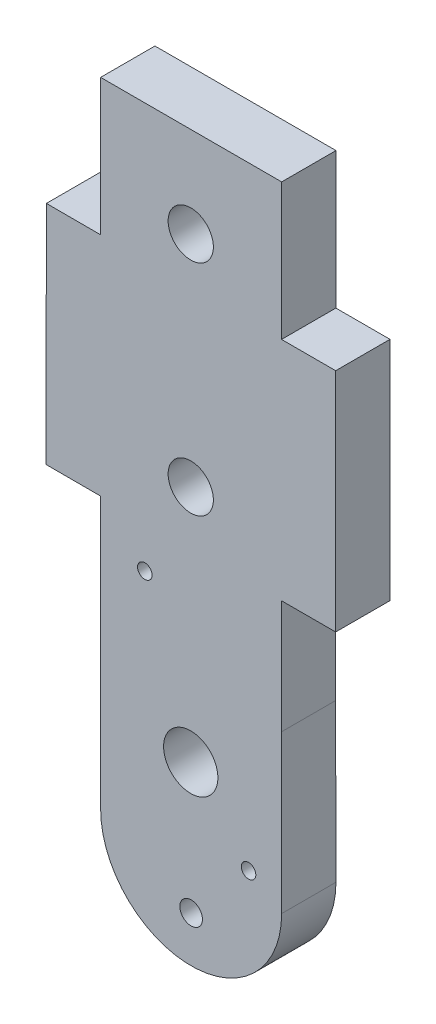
from build123d import *

# Parameters (mm, degrees)
SKETCH1_R           = 4
SKETCH1_R_2         = 1
SKETCH1_R_3         = 1.25
SKETCH1_R_4         = 2.5
BOSS_EXTRUDE1_DEPTH = 6
BOSS_EXTRUDE2_START = -6
SKETCH2_R           = 1
SKETCH2_R_2         = 0.8
BOSS_EXTRUDE2_DEPTH = 6
BOSS_EXTRUDE3_START = -6
SKETCH3_R           = 4
SKETCH3_R_2         = 3
BOSS_EXTRUDE3_DEPTH = 6


with BuildPart() as part:
    # Sketch1 → Boss-Extrude1 (new body)
    with BuildSketch(Plane.XY):
        with BuildLine():
            Line((237.342028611, -271.920774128), (237.298280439, -254.616663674))
            Line((237.298280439, -254.616663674), (237.308753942, -242.049865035))
            Line((237.308753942, -242.049865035), (243.308753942, -242.049865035))
            Line((243.308753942, -242.049865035), (243.308753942, -217.049865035))
            Line((243.308753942, -217.049865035), (237.329589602, -217.049865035))
            Line((237.329589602, -217.049865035), (237.342156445, -201.971337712))
            Line((237.342156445, -201.971337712), (217.342156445, -201.971337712))
            Line((217.342156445, -201.971337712), (217.342156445, -211.971337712))
            Line((217.342156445, -211.971337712), (217.342156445, -217.033196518))
            Line((217.342156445, -217.033196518), (217.329603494, -217.033196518))
            Line((217.329603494, -217.033196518), (211.350447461, -217.023230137))
            Line((211.350447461, -217.023230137), (211.308776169, -242.023195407))
            Line((211.308776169, -242.023195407), (217.308767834, -242.033196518))
            Line((217.308767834, -242.033196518), (217.342156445, -242.033196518))
            Line((217.342156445, -242.033196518), (217.342156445, -254.616663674))
            Line((217.342156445, -254.616663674), (217.342156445, -271.971337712))
            ThreePointArc((217.342156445, -271.971337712), (227.342156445, -281.971337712), (237.342156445, -271.971337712))
            Line((237.342156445, -271.971337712), (237.342028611, -271.920774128))
        make_face()
        with Locations((227.298280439, -262.507863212)):
            Circle(SKETCH1_R, mode=Mode.SUBTRACT)
        with Locations((222.224410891, -246.763849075)):
            Circle(SKETCH1_R_2, mode=Mode.SUBTRACT)
        with Locations((227.342156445, -276.90545404)):
            Circle(SKETCH1_R_3, mode=Mode.SUBTRACT)
        with Locations((233.684410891, -269.702891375)):
            Circle(SKETCH1_R_2, mode=Mode.SUBTRACT)
        with Locations((227.298280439, -236.176306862)):
            Circle(SKETCH1_R_4, mode=Mode.SUBTRACT)
        with Locations((227.298280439, -211.971337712)):
            Circle(SKETCH1_R_4, mode=Mode.SUBTRACT)
    extrude(amount=BOSS_EXTRUDE1_DEPTH)

    # Sketch2 → Boss-Extrude2 (add)
    # profile 1 of 2: a face of its own
    with BuildSketch(Plane.XY.offset(6).offset(BOSS_EXTRUDE2_START)):
        with Locations((222.224410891, -246.763849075)):
            Circle(SKETCH2_R)
        with Locations((222.224410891, -246.763849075)):
            Circle(SKETCH2_R_2, mode=Mode.SUBTRACT)
    # profile 2 of 2: a face of its own
    with BuildSketch(Plane.XY.offset(6).offset(BOSS_EXTRUDE2_START)):
        with Locations((233.684410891, -269.702891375)):
            Circle(SKETCH2_R)
        with Locations((233.684410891, -269.702891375)):
            Circle(SKETCH2_R_2, mode=Mode.SUBTRACT)
    extrude(amount=BOSS_EXTRUDE2_DEPTH)

    # Sketch3 → Boss-Extrude3 (add)
    with BuildSketch(Plane.XY.offset(6).offset(BOSS_EXTRUDE3_START)):
        with Locations((227.298280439, -262.507863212)):
            Circle(SKETCH3_R)
        with Locations((227.298280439, -262.507863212)):
            Circle(SKETCH3_R_2, mode=Mode.SUBTRACT)
    extrude(amount=BOSS_EXTRUDE3_DEPTH)


solid = part.part
